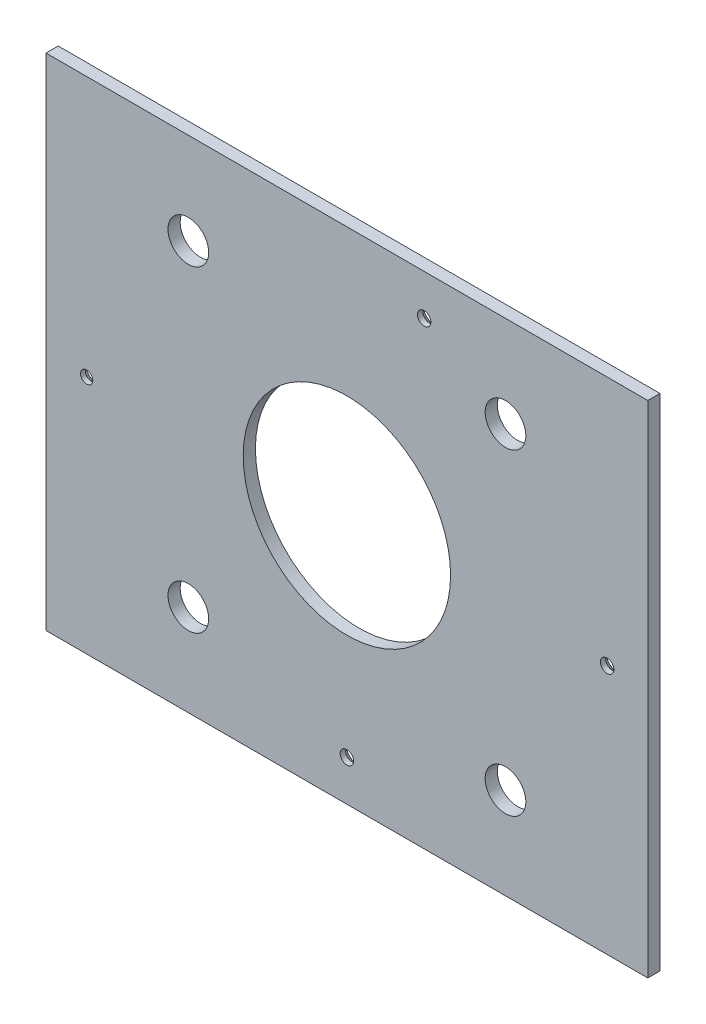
ISO-10303-21;
HEADER;
FILE_DESCRIPTION(('STEP AP214'),'2;1');
FILE_NAME('part.step','',(''),(''),'','','');
FILE_SCHEMA(('AUTOMOTIVE_DESIGN { 1 0 10303 214 1 1 1 1 }'));
ENDSEC;
DATA;
#1=APPLICATION_CONTEXT('core data for automotive mechanical design processes');
#2=APPLICATION_PROTOCOL_DEFINITION('international standard','automotive_design',2000,#1);
#3=PRODUCT_CONTEXT('',#1,'mechanical');
#4=PRODUCT('Part','Part','',(#3));
#5=PRODUCT_RELATED_PRODUCT_CATEGORY('part','',(#4));
#6=PRODUCT_DEFINITION_FORMATION('','',#4);
#7=PRODUCT_DEFINITION_CONTEXT('part definition',#1,'design');
#8=PRODUCT_DEFINITION('design','',#6,#7);
#9=PRODUCT_DEFINITION_SHAPE('','',#8);
#10=(LENGTH_UNIT() NAMED_UNIT(*) SI_UNIT(.MILLI.,.METRE.));
#11=(NAMED_UNIT(*) PLANE_ANGLE_UNIT() SI_UNIT($,.RADIAN.));
#12=(NAMED_UNIT(*) SI_UNIT($,.STERADIAN.) SOLID_ANGLE_UNIT());
#13=UNCERTAINTY_MEASURE_WITH_UNIT(LENGTH_MEASURE(1.E-05),#10,'distance_accuracy_value','');
#14=(GEOMETRIC_REPRESENTATION_CONTEXT(3) GLOBAL_UNCERTAINTY_ASSIGNED_CONTEXT((#13)) GLOBAL_UNIT_ASSIGNED_CONTEXT((#10,
#11,#12)) REPRESENTATION_CONTEXT('',''));
#15=CARTESIAN_POINT('',(0.,0.,0.));
#16=DIRECTION('',(0.,0.,1.));
#17=DIRECTION('',(1.,0.,0.));
#18=AXIS2_PLACEMENT_3D('',#15,#16,#17);
#19=CARTESIAN_POINT('',(38.,103.,0.));
#20=DIRECTION('',(0.,0.,-1.));
#21=DIRECTION('',(-1.,0.,0.));
#22=AXIS2_PLACEMENT_3D('',#19,#20,#21);
#23=CONICAL_SURFACE('',#22,6.69999999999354,0.785398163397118);
#24=CARTESIAN_POINT('',(38.,103.,-1.13686837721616E-10));
#25=DIRECTION('',(0.,0.,-1.));
#26=DIRECTION('',(-1.,0.,0.));
#27=AXIS2_PLACEMENT_3D('',#24,#25,#26);
#28=CIRCLE('',#27,6.70000000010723);
#29=CARTESIAN_POINT('',(31.2999999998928,103.,-1.13686837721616E-10));
#30=VERTEX_POINT('',#29);
#31=EDGE_CURVE('E76',#30,#30,#28,.T.);
#32=ORIENTED_EDGE('',*,*,#31,.T.);
#33=EDGE_LOOP('',(#32));
#34=FACE_BOUND('',#33,.T.);
#35=CARTESIAN_POINT('',(38.,103.,3.4));
#36=DIRECTION('',(0.,0.,1.));
#37=DIRECTION('',(0.,-1.,0.));
#38=AXIS2_PLACEMENT_3D('',#35,#36,#37);
#39=CIRCLE('',#38,3.3);
#40=CARTESIAN_POINT('',(38.,99.7,3.4));
#41=VERTEX_POINT('',#40);
#42=EDGE_CURVE('E87',#41,#41,#39,.T.);
#43=ORIENTED_EDGE('',*,*,#42,.T.);
#44=EDGE_LOOP('',(#43));
#45=FACE_BOUND('',#44,.T.);
#46=ADVANCED_FACE('F16',(#34,#45),#23,.F.);
#47=CARTESIAN_POINT('',(128.,0.,-1.13686837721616E-10));
#48=DIRECTION('',(0.,0.,-1.));
#49=DIRECTION('',(-1.,0.,0.));
#50=AXIS2_PLACEMENT_3D('',#47,#48,#49);
#51=CONICAL_SURFACE('',#50,6.70000000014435,0.785398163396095);
#52=CARTESIAN_POINT('',(128.,0.,-1.13686837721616E-10));
#53=DIRECTION('',(0.,0.,-1.));
#54=DIRECTION('',(-1.,0.,0.));
#55=AXIS2_PLACEMENT_3D('',#52,#53,#54);
#56=CIRCLE('',#55,6.70000000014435);
#57=CARTESIAN_POINT('',(121.299999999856,0.,-1.13686837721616E-10));
#58=VERTEX_POINT('',#57);
#59=EDGE_CURVE('E149',#58,#58,#56,.T.);
#60=ORIENTED_EDGE('',*,*,#59,.T.);
#61=EDGE_LOOP('',(#60));
#62=FACE_BOUND('',#61,.T.);
#63=CARTESIAN_POINT('',(128.,0.,3.4));
#64=DIRECTION('',(0.,0.,1.));
#65=DIRECTION('',(0.,-1.,0.));
#66=AXIS2_PLACEMENT_3D('',#63,#64,#65);
#67=CIRCLE('',#66,3.3);
#68=CARTESIAN_POINT('',(128.,-3.3,3.4));
#69=VERTEX_POINT('',#68);
#70=EDGE_CURVE('E107',#69,#69,#67,.T.);
#71=ORIENTED_EDGE('',*,*,#70,.T.);
#72=EDGE_LOOP('',(#71));
#73=FACE_BOUND('',#72,.T.);
#74=ADVANCED_FACE('F322',(#62,#73),#51,.F.);
#75=CARTESIAN_POINT('',(0.,-103.,-1.70530256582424E-10));
#76=DIRECTION('',(0.,0.,-1.));
#77=DIRECTION('',(-1.,0.,0.));
#78=AXIS2_PLACEMENT_3D('',#75,#76,#77);
#79=CONICAL_SURFACE('',#78,6.7000000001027,0.785398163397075);
#80=CARTESIAN_POINT('',(0.,-103.,0.));
#81=DIRECTION('',(0.,0.,-1.));
#82=DIRECTION('',(-1.,0.,0.));
#83=AXIS2_PLACEMENT_3D('',#80,#81,#82);
#84=CIRCLE('',#83,6.69999999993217);
#85=CARTESIAN_POINT('',(-6.69999999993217,-103.,0.));
#86=VERTEX_POINT('',#85);
#87=EDGE_CURVE('E151',#86,#86,#84,.T.);
#88=ORIENTED_EDGE('',*,*,#87,.T.);
#89=EDGE_LOOP('',(#88));
#90=FACE_BOUND('',#89,.T.);
#91=CARTESIAN_POINT('',(0.,-103.,3.4));
#92=DIRECTION('',(0.,0.,1.));
#93=DIRECTION('',(0.,-1.,0.));
#94=AXIS2_PLACEMENT_3D('',#91,#92,#93);
#95=CIRCLE('',#94,3.3);
#96=CARTESIAN_POINT('',(0.,-106.3,3.4));
#97=VERTEX_POINT('',#96);
#98=EDGE_CURVE('E104',#97,#97,#95,.T.);
#99=ORIENTED_EDGE('',*,*,#98,.T.);
#100=EDGE_LOOP('',(#99));
#101=FACE_BOUND('',#100,.T.);
#102=ADVANCED_FACE('F169',(#90,#101),#79,.F.);
#103=CARTESIAN_POINT('',(-128.,-5.,-1.13686837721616E-10));
#104=DIRECTION('',(0.,0.,-1.));
#105=DIRECTION('',(-1.,0.,0.));
#106=AXIS2_PLACEMENT_3D('',#103,#104,#105);
#107=CONICAL_SURFACE('',#106,6.7000000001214,0.785398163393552);
#108=CARTESIAN_POINT('',(-128.,-5.,3.7));
#109=DIRECTION('',(0.,0.,1.));
#110=DIRECTION('',(1.,0.,0.));
#111=AXIS2_PLACEMENT_3D('',#108,#109,#110);
#112=CIRCLE('',#111,3.);
#113=CARTESIAN_POINT('',(-125.,-5.,3.7));
#114=VERTEX_POINT('',#113);
#115=EDGE_CURVE('E100',#114,#114,#112,.T.);
#116=ORIENTED_EDGE('',*,*,#115,.T.);
#117=EDGE_LOOP('',(#116));
#118=FACE_BOUND('',#117,.T.);
#119=CARTESIAN_POINT('',(-128.,-5.,-1.13686837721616E-10));
#120=DIRECTION('',(0.,0.,-1.));
#121=DIRECTION('',(-1.,0.,0.));
#122=AXIS2_PLACEMENT_3D('',#119,#120,#121);
#123=CIRCLE('',#122,6.7000000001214);
#124=CARTESIAN_POINT('',(-134.700000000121,-5.,-1.13686837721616E-10));
#125=VERTEX_POINT('',#124);
#126=EDGE_CURVE('E20',#125,#125,#123,.T.);
#127=ORIENTED_EDGE('',*,*,#126,.T.);
#128=EDGE_LOOP('',(#127));
#129=FACE_BOUND('',#128,.T.);
#130=ADVANCED_FACE('F158',(#118,#129),#107,.F.);
#131=CARTESIAN_POINT('',(0.,0.,0.));
#132=DIRECTION('',(0.,0.,1.));
#133=DIRECTION('',(1.,0.,0.));
#134=AXIS2_PLACEMENT_3D('',#131,#132,#133);
#135=PLANE('',#134);
#136=ORIENTED_EDGE('',*,*,#31,.F.);
#137=EDGE_LOOP('',(#136));
#138=FACE_BOUND('',#137,.T.);
#139=ORIENTED_EDGE('',*,*,#59,.F.);
#140=EDGE_LOOP('',(#139));
#141=FACE_BOUND('',#140,.T.);
#142=ORIENTED_EDGE('',*,*,#87,.F.);
#143=EDGE_LOOP('',(#142));
#144=FACE_BOUND('',#143,.T.);
#145=CARTESIAN_POINT('',(0.,0.,0.));
#146=DIRECTION('',(0.,0.,1.));
#147=DIRECTION('',(1.,0.,0.));
#148=AXIS2_PLACEMENT_3D('',#145,#146,#147);
#149=CIRCLE('',#148,51.);
#150=CARTESIAN_POINT('',(51.,0.,0.));
#151=VERTEX_POINT('',#150);
#152=EDGE_CURVE('E99',#151,#151,#149,.T.);
#153=ORIENTED_EDGE('',*,*,#152,.T.);
#154=EDGE_LOOP('',(#153));
#155=FACE_BOUND('',#154,.T.);
#156=CARTESIAN_POINT('',(78.,-78.,0.));
#157=DIRECTION('',(0.,0.,-1.));
#158=DIRECTION('',(-1.,0.,0.));
#159=AXIS2_PLACEMENT_3D('',#156,#157,#158);
#160=CIRCLE('',#159,10.);
#161=CARTESIAN_POINT('',(68.,-78.,0.));
#162=VERTEX_POINT('',#161);
#163=EDGE_CURVE('E136',#162,#162,#160,.F.);
#164=ORIENTED_EDGE('',*,*,#163,.T.);
#165=EDGE_LOOP('',(#164));
#166=FACE_BOUND('',#165,.T.);
#167=CARTESIAN_POINT('',(78.,78.,0.));
#168=DIRECTION('',(0.,0.,-1.));
#169=DIRECTION('',(-1.,0.,0.));
#170=AXIS2_PLACEMENT_3D('',#167,#168,#169);
#171=CIRCLE('',#170,10.);
#172=CARTESIAN_POINT('',(68.,78.,0.));
#173=VERTEX_POINT('',#172);
#174=EDGE_CURVE('E139',#173,#173,#171,.F.);
#175=ORIENTED_EDGE('',*,*,#174,.T.);
#176=EDGE_LOOP('',(#175));
#177=FACE_BOUND('',#176,.T.);
#178=CARTESIAN_POINT('',(-78.,78.,0.));
#179=DIRECTION('',(0.,0.,-1.));
#180=DIRECTION('',(-1.,0.,0.));
#181=AXIS2_PLACEMENT_3D('',#178,#179,#180);
#182=CIRCLE('',#181,10.);
#183=CARTESIAN_POINT('',(-88.,78.,0.));
#184=VERTEX_POINT('',#183);
#185=EDGE_CURVE('E142',#184,#184,#182,.F.);
#186=ORIENTED_EDGE('',*,*,#185,.T.);
#187=EDGE_LOOP('',(#186));
#188=FACE_BOUND('',#187,.T.);
#189=CARTESIAN_POINT('',(-78.,-78.,0.));
#190=DIRECTION('',(0.,0.,-1.));
#191=DIRECTION('',(-1.,0.,0.));
#192=AXIS2_PLACEMENT_3D('',#189,#190,#191);
#193=CIRCLE('',#192,10.);
#194=CARTESIAN_POINT('',(-88.,-78.,0.));
#195=VERTEX_POINT('',#194);
#196=EDGE_CURVE('E103',#195,#195,#193,.F.);
#197=ORIENTED_EDGE('',*,*,#196,.T.);
#198=EDGE_LOOP('',(#197));
#199=FACE_BOUND('',#198,.T.);
#200=ORIENTED_EDGE('',*,*,#126,.F.);
#201=EDGE_LOOP('',(#200));
#202=FACE_BOUND('',#201,.T.);
#203=DIRECTION('',(0.,1.,0.));
#204=VECTOR('',#203,1.);
#205=CARTESIAN_POINT('',(148.,-123.,0.));
#206=LINE('',#205,#204);
#207=CARTESIAN_POINT('',(148.,-123.,0.));
#208=VERTEX_POINT('',#207);
#209=CARTESIAN_POINT('',(148.,123.,0.));
#210=VERTEX_POINT('',#209);
#211=EDGE_CURVE('E67',#208,#210,#206,.T.);
#212=ORIENTED_EDGE('',*,*,#211,.F.);
#213=DIRECTION('',(1.,0.,0.));
#214=VECTOR('',#213,1.);
#215=CARTESIAN_POINT('',(148.,-123.,0.));
#216=LINE('',#215,#214);
#217=CARTESIAN_POINT('',(-148.,-123.,0.));
#218=VERTEX_POINT('',#217);
#219=EDGE_CURVE('E63',#208,#218,#216,.F.);
#220=ORIENTED_EDGE('',*,*,#219,.T.);
#221=DIRECTION('',(0.,1.,0.));
#222=VECTOR('',#221,1.);
#223=CARTESIAN_POINT('',(-148.,123.,0.));
#224=LINE('',#223,#222);
#225=CARTESIAN_POINT('',(-148.,123.,0.));
#226=VERTEX_POINT('',#225);
#227=EDGE_CURVE('E66',#226,#218,#224,.F.);
#228=ORIENTED_EDGE('',*,*,#227,.F.);
#229=DIRECTION('',(1.,0.,0.));
#230=VECTOR('',#229,1.);
#231=CARTESIAN_POINT('',(-148.,123.,0.));
#232=LINE('',#231,#230);
#233=EDGE_CURVE('E56',#226,#210,#232,.T.);
#234=ORIENTED_EDGE('',*,*,#233,.T.);
#235=EDGE_LOOP('',(#212,#220,#228,#234));
#236=FACE_BOUND('',#235,.T.);
#237=ADVANCED_FACE('F65',(#138,#141,#144,#155,#166,#177,#188,#199,#202,#236),#135,.F.);
#238=CARTESIAN_POINT('',(-148.,123.,0.));
#239=DIRECTION('',(-1.,0.,0.));
#240=DIRECTION('',(0.,0.,1.));
#241=AXIS2_PLACEMENT_3D('',#238,#239,#240);
#242=PLANE('',#241);
#243=DIRECTION('',(0.,0.,1.));
#244=VECTOR('',#243,1.);
#245=CARTESIAN_POINT('',(-148.,-123.,0.));
#246=LINE('',#245,#244);
#247=CARTESIAN_POINT('',(-148.,-123.,6.));
#248=VERTEX_POINT('',#247);
#249=EDGE_CURVE('E71',#218,#248,#246,.T.);
#250=ORIENTED_EDGE('',*,*,#249,.T.);
#251=DIRECTION('',(0.,1.,0.));
#252=VECTOR('',#251,1.);
#253=CARTESIAN_POINT('',(-148.,0.,6.));
#254=LINE('',#253,#252);
#255=CARTESIAN_POINT('',(-148.,123.,6.));
#256=VERTEX_POINT('',#255);
#257=EDGE_CURVE('E49',#256,#248,#254,.F.);
#258=ORIENTED_EDGE('',*,*,#257,.F.);
#259=DIRECTION('',(0.,0.,-1.));
#260=VECTOR('',#259,1.);
#261=CARTESIAN_POINT('',(-148.,123.,0.));
#262=LINE('',#261,#260);
#263=EDGE_CURVE('E75',#256,#226,#262,.T.);
#264=ORIENTED_EDGE('',*,*,#263,.T.);
#265=ORIENTED_EDGE('',*,*,#227,.T.);
#266=EDGE_LOOP('',(#250,#258,#264,#265));
#267=FACE_BOUND('',#266,.T.);
#268=ADVANCED_FACE('F73',(#267),#242,.T.);
#269=CARTESIAN_POINT('',(148.,-123.,0.));
#270=DIRECTION('',(0.,1.,0.));
#271=DIRECTION('',(0.,0.,1.));
#272=AXIS2_PLACEMENT_3D('',#269,#270,#271);
#273=PLANE('',#272);
#274=ORIENTED_EDGE('',*,*,#219,.F.);
#275=DIRECTION('',(0.,0.,-1.));
#276=VECTOR('',#275,1.);
#277=CARTESIAN_POINT('',(148.,-123.,0.));
#278=LINE('',#277,#276);
#279=CARTESIAN_POINT('',(148.,-123.,6.));
#280=VERTEX_POINT('',#279);
#281=EDGE_CURVE('E81',#280,#208,#278,.T.);
#282=ORIENTED_EDGE('',*,*,#281,.F.);
#283=DIRECTION('',(1.,0.,0.));
#284=VECTOR('',#283,1.);
#285=CARTESIAN_POINT('',(0.,-123.,6.));
#286=LINE('',#285,#284);
#287=EDGE_CURVE('E80',#248,#280,#286,.T.);
#288=ORIENTED_EDGE('',*,*,#287,.F.);
#289=ORIENTED_EDGE('',*,*,#249,.F.);
#290=EDGE_LOOP('',(#274,#282,#288,#289));
#291=FACE_BOUND('',#290,.T.);
#292=ADVANCED_FACE('F78',(#291),#273,.F.);
#293=CARTESIAN_POINT('',(148.,-123.,0.));
#294=DIRECTION('',(1.,0.,0.));
#295=DIRECTION('',(0.,0.,-1.));
#296=AXIS2_PLACEMENT_3D('',#293,#294,#295);
#297=PLANE('',#296);
#298=DIRECTION('',(0.,0.,-1.));
#299=VECTOR('',#298,1.);
#300=CARTESIAN_POINT('',(148.,123.,0.));
#301=LINE('',#300,#299);
#302=CARTESIAN_POINT('',(148.,123.,6.));
#303=VERTEX_POINT('',#302);
#304=EDGE_CURVE('E35',#210,#303,#301,.F.);
#305=ORIENTED_EDGE('',*,*,#304,.T.);
#306=DIRECTION('',(0.,1.,0.));
#307=VECTOR('',#306,1.);
#308=CARTESIAN_POINT('',(148.,0.,6.));
#309=LINE('',#308,#307);
#310=EDGE_CURVE('E94',#280,#303,#309,.T.);
#311=ORIENTED_EDGE('',*,*,#310,.F.);
#312=ORIENTED_EDGE('',*,*,#281,.T.);
#313=ORIENTED_EDGE('',*,*,#211,.T.);
#314=EDGE_LOOP('',(#305,#311,#312,#313));
#315=FACE_BOUND('',#314,.T.);
#316=ADVANCED_FACE('F200',(#315),#297,.T.);
#317=CARTESIAN_POINT('',(-148.,123.,0.));
#318=DIRECTION('',(0.,-1.,0.));
#319=DIRECTION('',(0.,0.,-1.));
#320=AXIS2_PLACEMENT_3D('',#317,#318,#319);
#321=PLANE('',#320);
#322=ORIENTED_EDGE('',*,*,#233,.F.);
#323=ORIENTED_EDGE('',*,*,#263,.F.);
#324=DIRECTION('',(1.,0.,0.));
#325=VECTOR('',#324,1.);
#326=CARTESIAN_POINT('',(0.,123.,6.));
#327=LINE('',#326,#325);
#328=EDGE_CURVE('E90',#303,#256,#327,.F.);
#329=ORIENTED_EDGE('',*,*,#328,.F.);
#330=ORIENTED_EDGE('',*,*,#304,.F.);
#331=EDGE_LOOP('',(#322,#323,#329,#330));
#332=FACE_BOUND('',#331,.T.);
#333=ADVANCED_FACE('F202',(#332),#321,.F.);
#334=CARTESIAN_POINT('',(38.,103.,-49.5));
#335=DIRECTION('',(0.,0.,1.));
#336=DIRECTION('',(0.,-1.,0.));
#337=AXIS2_PLACEMENT_3D('',#334,#335,#336);
#338=CYLINDRICAL_SURFACE('',#337,3.3);
#339=ORIENTED_EDGE('',*,*,#42,.F.);
#340=EDGE_LOOP('',(#339));
#341=FACE_BOUND('',#340,.T.);
#342=CARTESIAN_POINT('',(38.,103.,6.));
#343=DIRECTION('',(0.,0.,1.));
#344=DIRECTION('',(0.,-1.,0.));
#345=AXIS2_PLACEMENT_3D('',#342,#343,#344);
#346=CIRCLE('',#345,3.3);
#347=CARTESIAN_POINT('',(38.,99.7,6.));
#348=VERTEX_POINT('',#347);
#349=EDGE_CURVE('E93',#348,#348,#346,.F.);
#350=ORIENTED_EDGE('',*,*,#349,.F.);
#351=EDGE_LOOP('',(#350));
#352=FACE_BOUND('',#351,.T.);
#353=ADVANCED_FACE('F204',(#341,#352),#338,.F.);
#354=CARTESIAN_POINT('',(128.,0.,-49.5));
#355=DIRECTION('',(0.,0.,1.));
#356=DIRECTION('',(0.,-1.,0.));
#357=AXIS2_PLACEMENT_3D('',#354,#355,#356);
#358=CYLINDRICAL_SURFACE('',#357,3.3);
#359=ORIENTED_EDGE('',*,*,#70,.F.);
#360=EDGE_LOOP('',(#359));
#361=FACE_BOUND('',#360,.T.);
#362=CARTESIAN_POINT('',(128.,0.,6.));
#363=DIRECTION('',(0.,0.,1.));
#364=DIRECTION('',(0.,-1.,0.));
#365=AXIS2_PLACEMENT_3D('',#362,#363,#364);
#366=CIRCLE('',#365,3.3);
#367=CARTESIAN_POINT('',(128.,-3.3,6.));
#368=VERTEX_POINT('',#367);
#369=EDGE_CURVE('E129',#368,#368,#366,.F.);
#370=ORIENTED_EDGE('',*,*,#369,.F.);
#371=EDGE_LOOP('',(#370));
#372=FACE_BOUND('',#371,.T.);
#373=ADVANCED_FACE('F210',(#361,#372),#358,.F.);
#374=CARTESIAN_POINT('',(0.,-103.,-49.5));
#375=DIRECTION('',(0.,0.,1.));
#376=DIRECTION('',(0.,-1.,0.));
#377=AXIS2_PLACEMENT_3D('',#374,#375,#376);
#378=CYLINDRICAL_SURFACE('',#377,3.3);
#379=ORIENTED_EDGE('',*,*,#98,.F.);
#380=EDGE_LOOP('',(#379));
#381=FACE_BOUND('',#380,.T.);
#382=CARTESIAN_POINT('',(0.,-103.,6.));
#383=DIRECTION('',(0.,0.,1.));
#384=DIRECTION('',(0.,-1.,0.));
#385=AXIS2_PLACEMENT_3D('',#382,#383,#384);
#386=CIRCLE('',#385,3.3);
#387=CARTESIAN_POINT('',(0.,-106.3,6.));
#388=VERTEX_POINT('',#387);
#389=EDGE_CURVE('E126',#388,#388,#386,.F.);
#390=ORIENTED_EDGE('',*,*,#389,.F.);
#391=EDGE_LOOP('',(#390));
#392=FACE_BOUND('',#391,.T.);
#393=ADVANCED_FACE('F218',(#381,#392),#378,.F.);
#394=CARTESIAN_POINT('',(-128.,-5.,0.1));
#395=DIRECTION('',(0.,0.,1.));
#396=DIRECTION('',(1.,0.,0.));
#397=AXIS2_PLACEMENT_3D('',#394,#395,#396);
#398=CYLINDRICAL_SURFACE('',#397,3.);
#399=ORIENTED_EDGE('',*,*,#115,.F.);
#400=EDGE_LOOP('',(#399));
#401=FACE_BOUND('',#400,.T.);
#402=CARTESIAN_POINT('',(-128.,-5.,6.));
#403=DIRECTION('',(0.,0.,1.));
#404=DIRECTION('',(1.,0.,0.));
#405=AXIS2_PLACEMENT_3D('',#402,#403,#404);
#406=CIRCLE('',#405,3.);
#407=CARTESIAN_POINT('',(-125.,-5.,6.));
#408=VERTEX_POINT('',#407);
#409=EDGE_CURVE('E123',#408,#408,#406,.F.);
#410=ORIENTED_EDGE('',*,*,#409,.F.);
#411=EDGE_LOOP('',(#410));
#412=FACE_BOUND('',#411,.T.);
#413=ADVANCED_FACE('F222',(#401,#412),#398,.F.);
#414=CARTESIAN_POINT('',(-78.,-78.,3.65999995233));
#415=DIRECTION('',(0.,0.,-1.));
#416=DIRECTION('',(-1.,0.,0.));
#417=AXIS2_PLACEMENT_3D('',#414,#415,#416);
#418=CYLINDRICAL_SURFACE('',#417,10.);
#419=ORIENTED_EDGE('',*,*,#196,.F.);
#420=EDGE_LOOP('',(#419));
#421=FACE_BOUND('',#420,.T.);
#422=CARTESIAN_POINT('',(-78.,-78.,6.));
#423=DIRECTION('',(0.,0.,-1.));
#424=DIRECTION('',(-1.,0.,0.));
#425=AXIS2_PLACEMENT_3D('',#422,#423,#424);
#426=CIRCLE('',#425,10.);
#427=CARTESIAN_POINT('',(-88.,-78.,6.));
#428=VERTEX_POINT('',#427);
#429=EDGE_CURVE('E120',#428,#428,#426,.T.);
#430=ORIENTED_EDGE('',*,*,#429,.F.);
#431=EDGE_LOOP('',(#430));
#432=FACE_BOUND('',#431,.T.);
#433=ADVANCED_FACE('F226',(#421,#432),#418,.F.);
#434=CARTESIAN_POINT('',(-78.,78.,3.65999995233));
#435=DIRECTION('',(0.,0.,-1.));
#436=DIRECTION('',(-1.,0.,0.));
#437=AXIS2_PLACEMENT_3D('',#434,#435,#436);
#438=CYLINDRICAL_SURFACE('',#437,10.);
#439=ORIENTED_EDGE('',*,*,#185,.F.);
#440=EDGE_LOOP('',(#439));
#441=FACE_BOUND('',#440,.T.);
#442=CARTESIAN_POINT('',(-78.,78.,6.));
#443=DIRECTION('',(0.,0.,-1.));
#444=DIRECTION('',(-1.,0.,0.));
#445=AXIS2_PLACEMENT_3D('',#442,#443,#444);
#446=CIRCLE('',#445,10.);
#447=CARTESIAN_POINT('',(-88.,78.,6.));
#448=VERTEX_POINT('',#447);
#449=EDGE_CURVE('E117',#448,#448,#446,.T.);
#450=ORIENTED_EDGE('',*,*,#449,.F.);
#451=EDGE_LOOP('',(#450));
#452=FACE_BOUND('',#451,.T.);
#453=ADVANCED_FACE('F230',(#441,#452),#438,.F.);
#454=CARTESIAN_POINT('',(78.,78.,3.65999995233));
#455=DIRECTION('',(0.,0.,-1.));
#456=DIRECTION('',(-1.,0.,0.));
#457=AXIS2_PLACEMENT_3D('',#454,#455,#456);
#458=CYLINDRICAL_SURFACE('',#457,10.);
#459=ORIENTED_EDGE('',*,*,#174,.F.);
#460=EDGE_LOOP('',(#459));
#461=FACE_BOUND('',#460,.T.);
#462=CARTESIAN_POINT('',(78.,78.,6.));
#463=DIRECTION('',(0.,0.,-1.));
#464=DIRECTION('',(-1.,0.,0.));
#465=AXIS2_PLACEMENT_3D('',#462,#463,#464);
#466=CIRCLE('',#465,10.);
#467=CARTESIAN_POINT('',(68.,78.,6.));
#468=VERTEX_POINT('',#467);
#469=EDGE_CURVE('E114',#468,#468,#466,.T.);
#470=ORIENTED_EDGE('',*,*,#469,.F.);
#471=EDGE_LOOP('',(#470));
#472=FACE_BOUND('',#471,.T.);
#473=ADVANCED_FACE('F234',(#461,#472),#458,.F.);
#474=CARTESIAN_POINT('',(78.,-78.,3.65999995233));
#475=DIRECTION('',(0.,0.,-1.));
#476=DIRECTION('',(-1.,0.,0.));
#477=AXIS2_PLACEMENT_3D('',#474,#475,#476);
#478=CYLINDRICAL_SURFACE('',#477,10.);
#479=ORIENTED_EDGE('',*,*,#163,.F.);
#480=EDGE_LOOP('',(#479));
#481=FACE_BOUND('',#480,.T.);
#482=CARTESIAN_POINT('',(78.,-78.,6.));
#483=DIRECTION('',(0.,0.,-1.));
#484=DIRECTION('',(-1.,0.,0.));
#485=AXIS2_PLACEMENT_3D('',#482,#483,#484);
#486=CIRCLE('',#485,10.);
#487=CARTESIAN_POINT('',(68.,-78.,6.));
#488=VERTEX_POINT('',#487);
#489=EDGE_CURVE('E26',#488,#488,#486,.T.);
#490=ORIENTED_EDGE('',*,*,#489,.F.);
#491=EDGE_LOOP('',(#490));
#492=FACE_BOUND('',#491,.T.);
#493=ADVANCED_FACE('F180',(#481,#492),#478,.F.);
#494=CARTESIAN_POINT('',(0.,0.,3.65999995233));
#495=DIRECTION('',(0.,0.,1.));
#496=DIRECTION('',(1.,0.,0.));
#497=AXIS2_PLACEMENT_3D('',#494,#495,#496);
#498=CYLINDRICAL_SURFACE('',#497,51.);
#499=ORIENTED_EDGE('',*,*,#152,.F.);
#500=EDGE_LOOP('',(#499));
#501=FACE_BOUND('',#500,.T.);
#502=CARTESIAN_POINT('',(0.,0.,6.));
#503=DIRECTION('',(0.,0.,1.));
#504=DIRECTION('',(1.,0.,0.));
#505=AXIS2_PLACEMENT_3D('',#502,#503,#504);
#506=CIRCLE('',#505,51.);
#507=CARTESIAN_POINT('',(51.,0.,6.));
#508=VERTEX_POINT('',#507);
#509=EDGE_CURVE('E11',#508,#508,#506,.F.);
#510=ORIENTED_EDGE('',*,*,#509,.F.);
#511=EDGE_LOOP('',(#510));
#512=FACE_BOUND('',#511,.T.);
#513=ADVANCED_FACE('F175',(#501,#512),#498,.F.);
#514=CARTESIAN_POINT('',(0.,0.,6.));
#515=DIRECTION('',(0.,0.,1.));
#516=DIRECTION('',(1.,0.,0.));
#517=AXIS2_PLACEMENT_3D('',#514,#515,#516);
#518=PLANE('',#517);
#519=ORIENTED_EDGE('',*,*,#509,.T.);
#520=EDGE_LOOP('',(#519));
#521=FACE_BOUND('',#520,.T.);
#522=ORIENTED_EDGE('',*,*,#489,.T.);
#523=EDGE_LOOP('',(#522));
#524=FACE_BOUND('',#523,.T.);
#525=ORIENTED_EDGE('',*,*,#469,.T.);
#526=EDGE_LOOP('',(#525));
#527=FACE_BOUND('',#526,.T.);
#528=ORIENTED_EDGE('',*,*,#449,.T.);
#529=EDGE_LOOP('',(#528));
#530=FACE_BOUND('',#529,.T.);
#531=ORIENTED_EDGE('',*,*,#429,.T.);
#532=EDGE_LOOP('',(#531));
#533=FACE_BOUND('',#532,.T.);
#534=ORIENTED_EDGE('',*,*,#409,.T.);
#535=EDGE_LOOP('',(#534));
#536=FACE_BOUND('',#535,.T.);
#537=ORIENTED_EDGE('',*,*,#389,.T.);
#538=EDGE_LOOP('',(#537));
#539=FACE_BOUND('',#538,.T.);
#540=ORIENTED_EDGE('',*,*,#369,.T.);
#541=EDGE_LOOP('',(#540));
#542=FACE_BOUND('',#541,.T.);
#543=ORIENTED_EDGE('',*,*,#349,.T.);
#544=EDGE_LOOP('',(#543));
#545=FACE_BOUND('',#544,.T.);
#546=ORIENTED_EDGE('',*,*,#310,.T.);
#547=ORIENTED_EDGE('',*,*,#328,.T.);
#548=ORIENTED_EDGE('',*,*,#257,.T.);
#549=ORIENTED_EDGE('',*,*,#287,.T.);
#550=EDGE_LOOP('',(#546,#547,#548,#549));
#551=FACE_BOUND('',#550,.T.);
#552=ADVANCED_FACE('F18',(#521,#524,#527,#530,#533,#536,#539,#542,#545,#551),#518,.T.);
#553=CLOSED_SHELL('',(#46,#74,#102,#130,#237,#268,#292,#316,#333,#353,#373,#393,#413,#433,#453,
#473,#493,#513,#552));
#554=MANIFOLD_SOLID_BREP('B1',#553);
#555=ADVANCED_BREP_SHAPE_REPRESENTATION('',(#18,#554),#14);
#556=SHAPE_DEFINITION_REPRESENTATION(#9,#555);
ENDSEC;
END-ISO-10303-21;
